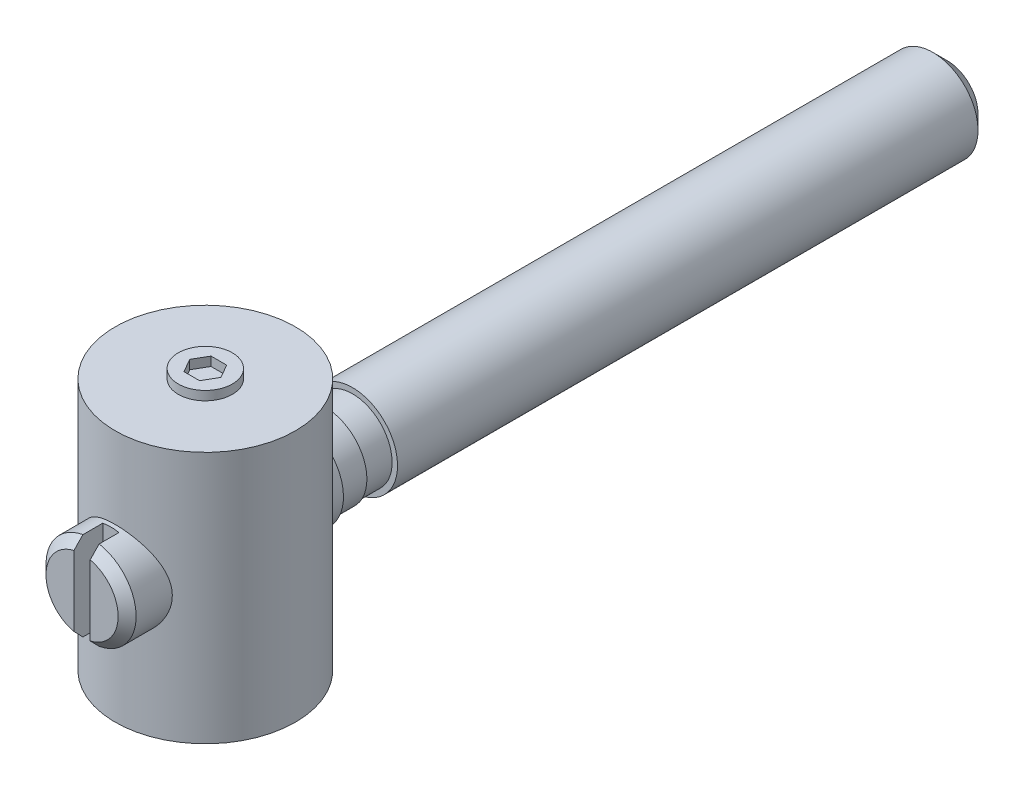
ISO-10303-21;
HEADER;
FILE_DESCRIPTION(('STEP AP214'),'2;1');
FILE_NAME('part.step','',(''),(''),'','','');
FILE_SCHEMA(('AUTOMOTIVE_DESIGN { 1 0 10303 214 1 1 1 1 }'));
ENDSEC;
DATA;
#1=APPLICATION_CONTEXT('core data for automotive mechanical design processes');
#2=APPLICATION_PROTOCOL_DEFINITION('international standard','automotive_design',2000,#1);
#3=PRODUCT_CONTEXT('',#1,'mechanical');
#4=PRODUCT('Part','Part','',(#3));
#5=PRODUCT_RELATED_PRODUCT_CATEGORY('part','',(#4));
#6=PRODUCT_DEFINITION_FORMATION('','',#4);
#7=PRODUCT_DEFINITION_CONTEXT('part definition',#1,'design');
#8=PRODUCT_DEFINITION('design','',#6,#7);
#9=PRODUCT_DEFINITION_SHAPE('','',#8);
#10=(LENGTH_UNIT() NAMED_UNIT(*) SI_UNIT(.MILLI.,.METRE.));
#11=(NAMED_UNIT(*) PLANE_ANGLE_UNIT() SI_UNIT($,.RADIAN.));
#12=(NAMED_UNIT(*) SI_UNIT($,.STERADIAN.) SOLID_ANGLE_UNIT());
#13=UNCERTAINTY_MEASURE_WITH_UNIT(LENGTH_MEASURE(1.E-05),#10,'distance_accuracy_value','');
#14=(GEOMETRIC_REPRESENTATION_CONTEXT(3) GLOBAL_UNCERTAINTY_ASSIGNED_CONTEXT((#13)) GLOBAL_UNIT_ASSIGNED_CONTEXT((#10,
#11,#12)) REPRESENTATION_CONTEXT('',''));
#15=CARTESIAN_POINT('',(0.,0.,0.));
#16=DIRECTION('',(0.,0.,1.));
#17=DIRECTION('',(1.,0.,0.));
#18=AXIS2_PLACEMENT_3D('',#15,#16,#17);
#19=CARTESIAN_POINT('',(0.,0.,6.8376561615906));
#20=DIRECTION('',(0.,0.,-1.));
#21=DIRECTION('',(0.,1.,0.));
#22=AXIS2_PLACEMENT_3D('',#19,#20,#21);
#23=PLANE('',#22);
#24=CARTESIAN_POINT('',(0.,0.,6.8376561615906));
#25=DIRECTION('',(0.,0.,-1.));
#26=DIRECTION('',(0.,1.,0.));
#27=AXIS2_PLACEMENT_3D('',#24,#25,#26);
#28=CIRCLE('',#27,2.);
#29=CARTESIAN_POINT('',(0.45,-1.9487175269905,6.8376561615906));
#30=VERTEX_POINT('',#29);
#31=CARTESIAN_POINT('',(0.45,1.94871752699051,6.8376561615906));
#32=VERTEX_POINT('',#31);
#33=EDGE_CURVE('E145',#30,#32,#28,.F.);
#34=ORIENTED_EDGE('',*,*,#33,.T.);
#35=DIRECTION('',(0.,1.,0.));
#36=VECTOR('',#35,1.);
#37=CARTESIAN_POINT('',(0.45,2.4591665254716,6.8376561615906));
#38=LINE('',#37,#36);
#39=EDGE_CURVE('E33',#30,#32,#38,.T.);
#40=ORIENTED_EDGE('',*,*,#39,.F.);
#41=EDGE_LOOP('',(#34,#40));
#42=FACE_BOUND('',#41,.T.);
#43=ADVANCED_FACE('F14',(#42),#23,.F.);
#44=CARTESIAN_POINT('',(-0.45,1.94871752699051,6.8376561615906));
#45=VERTEX_POINT('',#44);
#46=CARTESIAN_POINT('',(-0.45,-1.94871752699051,6.8376561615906));
#47=VERTEX_POINT('',#46);
#48=EDGE_CURVE('E134',#45,#47,#28,.F.);
#49=ORIENTED_EDGE('',*,*,#48,.T.);
#50=DIRECTION('',(0.,-1.,0.));
#51=VECTOR('',#50,1.);
#52=CARTESIAN_POINT('',(-0.45,2.4591665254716,6.8376561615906));
#53=LINE('',#52,#51);
#54=EDGE_CURVE('E297',#45,#47,#53,.T.);
#55=ORIENTED_EDGE('',*,*,#54,.F.);
#56=EDGE_LOOP('',(#49,#55));
#57=FACE_BOUND('',#56,.T.);
#58=ADVANCED_FACE('F181',(#57),#23,.F.);
#59=CARTESIAN_POINT('',(0.,0.,6.8376561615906));
#60=DIRECTION('',(0.,0.,-1.));
#61=DIRECTION('',(0.,1.,0.));
#62=AXIS2_PLACEMENT_3D('',#59,#60,#61);
#63=CONICAL_SURFACE('',#62,2.,0.785398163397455);
#64=CARTESIAN_POINT('',(0.45,-5.42557622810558,3.39345030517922));
#65=CARTESIAN_POINT('',(0.450000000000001,-5.23197486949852,3.58638323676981));
#66=CARTESIAN_POINT('',(0.450000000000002,-5.03834381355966,3.77928640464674));
#67=CARTESIAN_POINT('',(0.450000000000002,-4.65097063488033,4.16500261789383));
#68=CARTESIAN_POINT('',(0.450000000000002,-4.45722850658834,4.35781565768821));
#69=CARTESIAN_POINT('',(0.450000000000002,-4.06948715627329,4.7434147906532));
#70=CARTESIAN_POINT('',(0.450000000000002,-3.87548784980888,4.93620079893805));
#71=CARTESIAN_POINT('',(0.450000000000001,-3.48727998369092,5.32154115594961));
#72=CARTESIAN_POINT('',(0.450000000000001,-3.2930714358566,5.51409551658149));
#73=CARTESIAN_POINT('',(0.450000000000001,-2.91518099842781,5.88806787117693));
#74=CARTESIAN_POINT('',(0.450000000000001,-2.73151868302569,6.06950562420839));
#75=CARTESIAN_POINT('',(0.450000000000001,-2.45557699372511,6.3412370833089));
#76=CARTESIAN_POINT('',(0.450000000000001,-2.36351424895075,6.43175069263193));
#77=CARTESIAN_POINT('',(0.450000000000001,-2.17918444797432,6.61256698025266));
#78=CARTESIAN_POINT('',(0.450000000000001,-2.08691739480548,6.70286966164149));
#79=CARTESIAN_POINT('',(0.450000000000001,-1.90209588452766,6.88316070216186));
#80=CARTESIAN_POINT('',(0.450000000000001,-1.80954145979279,6.97314909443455));
#81=CARTESIAN_POINT('',(0.450000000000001,-1.62396889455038,7.15265715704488));
#82=CARTESIAN_POINT('',(0.450000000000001,-1.53095072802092,7.24217680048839));
#83=CARTESIAN_POINT('',(0.450000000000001,-1.34419825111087,7.42041554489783));
#84=CARTESIAN_POINT('',(0.450000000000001,-1.25046415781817,7.50913487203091));
#85=CARTESIAN_POINT('',(0.450000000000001,-1.10883677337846,7.64110521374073));
#86=CARTESIAN_POINT('',(0.450000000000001,-1.06145881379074,7.68490855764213));
#87=CARTESIAN_POINT('',(0.450000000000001,-0.966208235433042,7.77197331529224));
#88=CARTESIAN_POINT('',(0.45,-0.918335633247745,7.81523474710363));
#89=CARTESIAN_POINT('',(0.45,-0.843045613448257,7.88210740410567));
#90=CARTESIAN_POINT('',(0.450000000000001,-0.815880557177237,7.90600247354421));
#91=CARTESIAN_POINT('',(0.450000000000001,-0.761250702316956,7.95345109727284));
#92=CARTESIAN_POINT('',(0.450000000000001,-0.73378588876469,7.97700463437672));
#93=CARTESIAN_POINT('',(0.450000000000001,-0.678493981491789,8.02363326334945));
#94=CARTESIAN_POINT('',(0.450000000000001,-0.650667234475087,8.04670876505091));
#95=CARTESIAN_POINT('',(0.450000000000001,-0.594503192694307,8.09222815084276));
#96=CARTESIAN_POINT('',(0.45,-0.566165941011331,8.1146720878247));
#97=CARTESIAN_POINT('',(0.45,-0.508352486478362,8.15900200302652));
#98=CARTESIAN_POINT('',(0.450000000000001,-0.478865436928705,8.18087393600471));
#99=CARTESIAN_POINT('',(0.450000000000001,-0.418849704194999,8.22326079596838));
#100=CARTESIAN_POINT('',(0.450000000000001,-0.38831949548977,8.24377359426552));
#101=CARTESIAN_POINT('',(0.450000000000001,-0.326169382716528,8.28241108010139));
#102=CARTESIAN_POINT('',(0.450000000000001,-0.294562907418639,8.30055698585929));
#103=CARTESIAN_POINT('',(0.45,-0.229579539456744,8.33325387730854));
#104=CARTESIAN_POINT('',(0.45,-0.196208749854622,8.34781638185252));
#105=CARTESIAN_POINT('',(0.45,-0.135363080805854,8.3683918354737));
#106=CARTESIAN_POINT('',(0.450000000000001,-0.108310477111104,8.37560333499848));
#107=CARTESIAN_POINT('',(0.450000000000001,-0.0534100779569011,8.38529470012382));
#108=CARTESIAN_POINT('',(0.45,-0.0255652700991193,8.38779043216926));
#109=CARTESIAN_POINT('',(0.45,0.0301828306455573,8.38751005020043));
#110=CARTESIAN_POINT('',(0.450000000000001,0.0580860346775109,8.38471745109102));
#111=CARTESIAN_POINT('',(0.450000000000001,0.113057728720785,8.3744670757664));
#112=CARTESIAN_POINT('',(0.45,0.140123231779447,8.36699426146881));
#113=CARTESIAN_POINT('',(0.45,0.195788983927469,8.34767787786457));
#114=CARTESIAN_POINT('',(0.45,0.224253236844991,8.33545861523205));
#115=CARTESIAN_POINT('',(0.450000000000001,0.279866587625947,8.30828364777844));
#116=CARTESIAN_POINT('',(0.450000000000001,0.307012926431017,8.29332249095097));
#117=CARTESIAN_POINT('',(0.450000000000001,0.360452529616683,8.2614943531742));
#118=CARTESIAN_POINT('',(0.450000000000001,0.386736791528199,8.2446125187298));
#119=CARTESIAN_POINT('',(0.45,0.438454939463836,8.20965869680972));
#120=CARTESIAN_POINT('',(0.45,0.463889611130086,8.19158785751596));
#121=CARTESIAN_POINT('',(0.45,0.516620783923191,8.15278577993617));
#122=CARTESIAN_POINT('',(0.45,0.543853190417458,8.13196802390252));
#123=CARTESIAN_POINT('',(0.450000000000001,0.597765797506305,8.08962702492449));
#124=CARTESIAN_POINT('',(0.45,0.624445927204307,8.06810369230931));
#125=CARTESIAN_POINT('',(0.45,0.703891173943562,8.00276414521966));
#126=CARTESIAN_POINT('',(0.45,0.756036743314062,7.95819695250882));
#127=CARTESIAN_POINT('',(0.45,0.859426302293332,7.86786663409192));
#128=CARTESIAN_POINT('',(0.45,0.910668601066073,7.82210159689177));
#129=CARTESIAN_POINT('',(0.45,1.01249538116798,7.7298738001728));
#130=CARTESIAN_POINT('',(0.45,1.06308003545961,7.68341123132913));
#131=CARTESIAN_POINT('',(0.45,1.16360564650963,7.59020812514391));
#132=CARTESIAN_POINT('',(0.45,1.21354839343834,7.54346951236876));
#133=CARTESIAN_POINT('',(0.45,1.31312844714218,7.44966163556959));
#134=CARTESIAN_POINT('',(0.45,1.3627657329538,7.4025923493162));
#135=CARTESIAN_POINT('',(0.45,1.51124171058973,7.26112807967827));
#136=CARTESIAN_POINT('',(0.45,1.6097456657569,7.16638213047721));
#137=CARTESIAN_POINT('',(0.45,1.86456693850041,6.91997152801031));
#138=CARTESIAN_POINT('',(0.45,2.02049383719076,6.76790421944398));
#139=CARTESIAN_POINT('',(0.45,2.33171348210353,6.46311867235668));
#140=CARTESIAN_POINT('',(0.45,2.48700621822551,6.31040042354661));
#141=CARTESIAN_POINT('',(0.45,2.7972928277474,6.00451859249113));
#142=CARTESIAN_POINT('',(0.45,2.95228653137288,5.85135483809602));
#143=CARTESIAN_POINT('',(0.45,3.26204211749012,5.54479507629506));
#144=CARTESIAN_POINT('',(0.45,3.41680400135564,5.39139907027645));
#145=CARTESIAN_POINT('',(0.45,3.88099551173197,4.93085423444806));
#146=CARTESIAN_POINT('',(0.45,4.1901997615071,4.62347828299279));
#147=CARTESIAN_POINT('',(0.449999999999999,4.65370644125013,4.16226681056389));
#148=CARTESIAN_POINT('',(0.449999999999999,4.8081204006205,4.00854326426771));
#149=CARTESIAN_POINT('',(0.449999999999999,5.11688894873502,3.70103724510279));
#150=CARTESIAN_POINT('',(0.45,5.27124353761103,3.54725477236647));
#151=CARTESIAN_POINT('',(0.45,5.42557622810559,3.39345030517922));
#152=B_SPLINE_CURVE_WITH_KNOTS('',3,(#64,#65,#66,#67,#68,#69,#70,#71,#72,#73,#74,#75,#76,#77,
#78,#79,#80,#81,#82,#83,#84,#85,#86,#87,#88,#89,#90,#91,#92,#93,#94,#95,#96,#97,#98,#99,#100,
#101,#102,#103,#104,#105,#106,#107,#108,#109,#110,#111,#112,#113,#114,#115,#116,#117,#118,#119,
#120,#121,#122,#123,#124,#125,#126,#127,#128,#129,#130,#131,#132,#133,#134,#135,#136,#137,#138,
#139,#140,#141,#142,#143,#144,#145,#146,#147,#148,#149,#150,#151),.UNSPECIFIED.,.F.,.F.,(4,2,2,
2,2,2,2,2,2,2,2,2,2,2,2,2,2,2,2,2,2,2,2,2,2,2,2,2,2,2,2,2,2,2,2,2,2,2,2,2,2,2,2,4),(0.,
0.819964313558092,1.63997398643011,2.46047345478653,3.2809287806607,4.05543648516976,
4.44275311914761,4.83006404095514,5.21733280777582,5.60462355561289,5.99180119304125,
6.18537215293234,6.37893664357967,6.48747135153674,6.59601150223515,6.70445438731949,
6.81288816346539,6.92300307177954,7.0332865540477,7.14250119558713,7.2513600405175,
7.3350321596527,7.41842225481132,7.5020727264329,7.58599336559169,7.67870028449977,
7.77159358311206,7.86526158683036,7.95884042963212,8.06165788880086,8.16448846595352,
8.37024155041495,8.576345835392,8.78239477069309,8.98759769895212,9.19281455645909,
9.60283291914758,10.2562345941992,10.9096466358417,11.5633584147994,12.217066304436,
13.5250356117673,14.1786956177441,14.8323541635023),.UNSPECIFIED.);
#153=CARTESIAN_POINT('',(0.45,-2.4591665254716,6.3376561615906));
#154=VERTEX_POINT('',#153);
#155=EDGE_CURVE('E161',#154,#30,#152,.T.);
#156=ORIENTED_EDGE('',*,*,#155,.F.);
#157=CARTESIAN_POINT('',(0.,0.,6.3376561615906));
#158=DIRECTION('',(0.,0.,-1.));
#159=DIRECTION('',(0.,1.,0.));
#160=AXIS2_PLACEMENT_3D('',#157,#158,#159);
#161=CIRCLE('',#160,2.5);
#162=CARTESIAN_POINT('',(0.45,2.4591665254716,6.3376561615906));
#163=VERTEX_POINT('',#162);
#164=EDGE_CURVE('E141',#163,#154,#161,.T.);
#165=ORIENTED_EDGE('',*,*,#164,.F.);
#166=EDGE_CURVE('E154',#32,#163,#152,.T.);
#167=ORIENTED_EDGE('',*,*,#166,.F.);
#168=ORIENTED_EDGE('',*,*,#33,.F.);
#169=EDGE_LOOP('',(#156,#165,#167,#168));
#170=FACE_BOUND('',#169,.T.);
#171=ADVANCED_FACE('F168',(#170),#63,.T.);
#172=CARTESIAN_POINT('',(0.45,2.4591665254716,5.2376561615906));
#173=DIRECTION('',(1.,0.,0.));
#174=DIRECTION('',(0.,1.,0.));
#175=AXIS2_PLACEMENT_3D('',#172,#173,#174);
#176=PLANE('',#175);
#177=ORIENTED_EDGE('',*,*,#155,.T.);
#178=ORIENTED_EDGE('',*,*,#39,.T.);
#179=ORIENTED_EDGE('',*,*,#166,.T.);
#180=DIRECTION('',(0.,0.,1.));
#181=VECTOR('',#180,1.);
#182=CARTESIAN_POINT('',(0.45,2.4591665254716,5.2376561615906));
#183=LINE('',#182,#181);
#184=CARTESIAN_POINT('',(0.45,2.4591665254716,5.2376561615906));
#185=VERTEX_POINT('',#184);
#186=EDGE_CURVE('E125',#185,#163,#183,.T.);
#187=ORIENTED_EDGE('',*,*,#186,.F.);
#188=DIRECTION('',(0.,1.,0.));
#189=VECTOR('',#188,1.);
#190=CARTESIAN_POINT('',(0.45,2.4591665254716,5.2376561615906));
#191=LINE('',#190,#189);
#192=CARTESIAN_POINT('',(0.45,-2.4591665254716,5.2376561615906));
#193=VERTEX_POINT('',#192);
#194=EDGE_CURVE('E89',#193,#185,#191,.T.);
#195=ORIENTED_EDGE('',*,*,#194,.F.);
#196=DIRECTION('',(0.,0.,1.));
#197=VECTOR('',#196,1.);
#198=CARTESIAN_POINT('',(0.45,-2.4591665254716,5.2376561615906));
#199=LINE('',#198,#197);
#200=EDGE_CURVE('E308',#193,#154,#199,.T.);
#201=ORIENTED_EDGE('',*,*,#200,.T.);
#202=EDGE_LOOP('',(#177,#178,#179,#187,#195,#201));
#203=FACE_BOUND('',#202,.T.);
#204=ADVANCED_FACE('F172',(#203),#176,.F.);
#205=CARTESIAN_POINT('',(0.,0.,5.2376561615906));
#206=DIRECTION('',(0.,0.,1.));
#207=DIRECTION('',(0.,-1.,0.));
#208=AXIS2_PLACEMENT_3D('',#205,#206,#207);
#209=PLANE('',#208);
#210=CARTESIAN_POINT('',(0.,0.,5.2376561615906));
#211=DIRECTION('',(0.,0.,1.));
#212=DIRECTION('',(0.,-1.,0.));
#213=AXIS2_PLACEMENT_3D('',#210,#211,#212);
#214=CIRCLE('',#213,2.5);
#215=CARTESIAN_POINT('',(-0.45,-2.4591665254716,5.2376561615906));
#216=VERTEX_POINT('',#215);
#217=EDGE_CURVE('E299',#216,#193,#214,.T.);
#218=ORIENTED_EDGE('',*,*,#217,.T.);
#219=ORIENTED_EDGE('',*,*,#194,.T.);
#220=CARTESIAN_POINT('',(0.,0.,5.2376561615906));
#221=DIRECTION('',(0.,0.,1.));
#222=DIRECTION('',(0.,-1.,0.));
#223=AXIS2_PLACEMENT_3D('',#220,#221,#222);
#224=CIRCLE('',#223,2.5);
#225=CARTESIAN_POINT('',(-0.45,2.4591665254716,5.2376561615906));
#226=VERTEX_POINT('',#225);
#227=EDGE_CURVE('E333',#185,#226,#224,.T.);
#228=ORIENTED_EDGE('',*,*,#227,.T.);
#229=DIRECTION('',(0.,-1.,0.));
#230=VECTOR('',#229,1.);
#231=CARTESIAN_POINT('',(-0.45,2.4591665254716,5.2376561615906));
#232=LINE('',#231,#230);
#233=EDGE_CURVE('E120',#226,#216,#232,.T.);
#234=ORIENTED_EDGE('',*,*,#233,.T.);
#235=EDGE_LOOP('',(#218,#219,#228,#234));
#236=FACE_BOUND('',#235,.T.);
#237=ADVANCED_FACE('F176',(#236),#209,.T.);
#238=CARTESIAN_POINT('',(-0.45,2.4591665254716,5.2376561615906));
#239=DIRECTION('',(-1.,0.,0.));
#240=DIRECTION('',(0.,-1.,0.));
#241=AXIS2_PLACEMENT_3D('',#238,#239,#240);
#242=PLANE('',#241);
#243=CARTESIAN_POINT('',(-0.45,5.42557622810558,3.39345030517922));
#244=CARTESIAN_POINT('',(-0.45,5.23197486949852,3.58638323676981));
#245=CARTESIAN_POINT('',(-0.45,5.03834381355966,3.77928640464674));
#246=CARTESIAN_POINT('',(-0.45,4.65097063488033,4.16500261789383));
#247=CARTESIAN_POINT('',(-0.45,4.45722850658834,4.35781565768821));
#248=CARTESIAN_POINT('',(-0.45,4.06948715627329,4.7434147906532));
#249=CARTESIAN_POINT('',(-0.45,3.87548784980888,4.93620079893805));
#250=CARTESIAN_POINT('',(-0.45,3.48727998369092,5.32154115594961));
#251=CARTESIAN_POINT('',(-0.45,3.2930714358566,5.5140955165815));
#252=CARTESIAN_POINT('',(-0.45,2.9151809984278,5.88806787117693));
#253=CARTESIAN_POINT('',(-0.45,2.73151868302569,6.06950562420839));
#254=CARTESIAN_POINT('',(-0.45,2.45557699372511,6.3412370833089));
#255=CARTESIAN_POINT('',(-0.45,2.36351424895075,6.43175069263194));
#256=CARTESIAN_POINT('',(-0.45,2.17918444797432,6.61256698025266));
#257=CARTESIAN_POINT('',(-0.45,2.08691739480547,6.7028696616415));
#258=CARTESIAN_POINT('',(-0.45,1.90209588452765,6.88316070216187));
#259=CARTESIAN_POINT('',(-0.45,1.80954145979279,6.97314909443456));
#260=CARTESIAN_POINT('',(-0.45,1.62396889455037,7.15265715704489));
#261=CARTESIAN_POINT('',(-0.45,1.53095072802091,7.2421768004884));
#262=CARTESIAN_POINT('',(-0.45,1.34419825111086,7.42041554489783));
#263=CARTESIAN_POINT('',(-0.45,1.25046415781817,7.50913487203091));
#264=CARTESIAN_POINT('',(-0.45,1.10883677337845,7.64110521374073));
#265=CARTESIAN_POINT('',(-0.45,1.06145881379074,7.68490855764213));
#266=CARTESIAN_POINT('',(-0.45,0.966208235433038,7.77197331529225));
#267=CARTESIAN_POINT('',(-0.45,0.918335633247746,7.81523474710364));
#268=CARTESIAN_POINT('',(-0.45,0.843045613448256,7.88210740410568));
#269=CARTESIAN_POINT('',(-0.45,0.815880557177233,7.90600247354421));
#270=CARTESIAN_POINT('',(-0.45,0.761250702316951,7.95345109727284));
#271=CARTESIAN_POINT('',(-0.45,0.733785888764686,7.97700463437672));
#272=CARTESIAN_POINT('',(-0.45,0.678493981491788,8.02363326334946));
#273=CARTESIAN_POINT('',(-0.45,0.650667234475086,8.04670876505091));
#274=CARTESIAN_POINT('',(-0.45,0.594503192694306,8.09222815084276));
#275=CARTESIAN_POINT('',(-0.45,0.56616594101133,8.11467208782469));
#276=CARTESIAN_POINT('',(-0.45,0.508352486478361,8.15900200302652));
#277=CARTESIAN_POINT('',(-0.45,0.478865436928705,8.18087393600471));
#278=CARTESIAN_POINT('',(-0.45,0.418849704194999,8.22326079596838));
#279=CARTESIAN_POINT('',(-0.45,0.38831949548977,8.24377359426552));
#280=CARTESIAN_POINT('',(-0.45,0.326169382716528,8.28241108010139));
#281=CARTESIAN_POINT('',(-0.45,0.29456290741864,8.30055698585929));
#282=CARTESIAN_POINT('',(-0.45,0.229579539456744,8.33325387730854));
#283=CARTESIAN_POINT('',(-0.45,0.196208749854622,8.34781638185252));
#284=CARTESIAN_POINT('',(-0.45,0.135363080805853,8.3683918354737));
#285=CARTESIAN_POINT('',(-0.45,0.108310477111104,8.37560333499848));
#286=CARTESIAN_POINT('',(-0.45,0.0534100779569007,8.38529470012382));
#287=CARTESIAN_POINT('',(-0.45,0.0255652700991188,8.38779043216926));
#288=CARTESIAN_POINT('',(-0.45,-0.030182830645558,8.38751005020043));
#289=CARTESIAN_POINT('',(-0.45,-0.0580860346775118,8.38471745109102));
#290=CARTESIAN_POINT('',(-0.45,-0.113057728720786,8.3744670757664));
#291=CARTESIAN_POINT('',(-0.45,-0.140123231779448,8.36699426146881));
#292=CARTESIAN_POINT('',(-0.45,-0.195788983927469,8.34767787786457));
#293=CARTESIAN_POINT('',(-0.45,-0.224253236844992,8.33545861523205));
#294=CARTESIAN_POINT('',(-0.45,-0.279866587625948,8.30828364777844));
#295=CARTESIAN_POINT('',(-0.45,-0.307012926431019,8.29332249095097));
#296=CARTESIAN_POINT('',(-0.45,-0.360452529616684,8.2614943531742));
#297=CARTESIAN_POINT('',(-0.45,-0.3867367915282,8.2446125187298));
#298=CARTESIAN_POINT('',(-0.45,-0.438454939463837,8.20965869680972));
#299=CARTESIAN_POINT('',(-0.45,-0.463889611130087,8.19158785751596));
#300=CARTESIAN_POINT('',(-0.45,-0.516620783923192,8.15278577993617));
#301=CARTESIAN_POINT('',(-0.45,-0.54385319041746,8.13196802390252));
#302=CARTESIAN_POINT('',(-0.45,-0.597765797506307,8.08962702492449));
#303=CARTESIAN_POINT('',(-0.45,-0.62444592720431,8.06810369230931));
#304=CARTESIAN_POINT('',(-0.45,-0.703891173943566,8.00276414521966));
#305=CARTESIAN_POINT('',(-0.45,-0.756036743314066,7.95819695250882));
#306=CARTESIAN_POINT('',(-0.45,-0.859426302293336,7.86786663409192));
#307=CARTESIAN_POINT('',(-0.45,-0.910668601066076,7.82210159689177));
#308=CARTESIAN_POINT('',(-0.45,-1.01249538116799,7.72987380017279));
#309=CARTESIAN_POINT('',(-0.45,-1.06308003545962,7.68341123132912));
#310=CARTESIAN_POINT('',(-0.45,-1.16360564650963,7.5902081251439));
#311=CARTESIAN_POINT('',(-0.45,-1.21354839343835,7.54346951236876));
#312=CARTESIAN_POINT('',(-0.45,-1.31312844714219,7.44966163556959));
#313=CARTESIAN_POINT('',(-0.45,-1.3627657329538,7.4025923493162));
#314=CARTESIAN_POINT('',(-0.45,-1.51124171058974,7.26112807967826));
#315=CARTESIAN_POINT('',(-0.45,-1.60974566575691,7.1663821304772));
#316=CARTESIAN_POINT('',(-0.45,-1.86456693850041,6.9199715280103));
#317=CARTESIAN_POINT('',(-0.45,-2.02049383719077,6.76790421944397));
#318=CARTESIAN_POINT('',(-0.45,-2.33171348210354,6.46311867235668));
#319=CARTESIAN_POINT('',(-0.45,-2.48700621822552,6.31040042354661));
#320=CARTESIAN_POINT('',(-0.45,-2.7972928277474,6.00451859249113));
#321=CARTESIAN_POINT('',(-0.45,-2.95228653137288,5.85135483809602));
#322=CARTESIAN_POINT('',(-0.45,-3.26204211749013,5.54479507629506));
#323=CARTESIAN_POINT('',(-0.45,-3.41680400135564,5.39139907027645));
#324=CARTESIAN_POINT('',(-0.45,-3.88099551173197,4.93085423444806));
#325=CARTESIAN_POINT('',(-0.45,-4.1901997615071,4.62347828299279));
#326=CARTESIAN_POINT('',(-0.45,-4.65370644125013,4.16226681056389));
#327=CARTESIAN_POINT('',(-0.45,-4.8081204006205,4.00854326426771));
#328=CARTESIAN_POINT('',(-0.45,-5.11688894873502,3.7010372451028));
#329=CARTESIAN_POINT('',(-0.45,-5.27124353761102,3.54725477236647));
#330=CARTESIAN_POINT('',(-0.45,-5.42557622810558,3.39345030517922));
#331=B_SPLINE_CURVE_WITH_KNOTS('',3,(#243,#244,#245,#246,#247,#248,#249,#250,#251,#252,#253,
#254,#255,#256,#257,#258,#259,#260,#261,#262,#263,#264,#265,#266,#267,#268,#269,#270,#271,#272,
#273,#274,#275,#276,#277,#278,#279,#280,#281,#282,#283,#284,#285,#286,#287,#288,#289,#290,#291,
#292,#293,#294,#295,#296,#297,#298,#299,#300,#301,#302,#303,#304,#305,#306,#307,#308,#309,#310,
#311,#312,#313,#314,#315,#316,#317,#318,#319,#320,#321,#322,#323,#324,#325,#326,#327,#328,#329,
#330),.UNSPECIFIED.,.F.,.F.,(4,2,2,2,2,2,2,2,2,2,2,2,2,2,2,2,2,2,2,2,2,2,2,2,2,2,2,2,2,2,2,2,2,
2,2,2,2,2,2,2,2,2,2,4),(0.,0.819964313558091,1.63997398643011,2.46047345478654,3.2809287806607,
4.05543648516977,4.44275311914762,4.83006404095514,5.21733280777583,5.60462355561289,
5.99180119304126,6.18537215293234,6.37893664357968,6.48747135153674,6.59601150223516,
6.70445438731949,6.81288816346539,6.92300307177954,7.0332865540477,7.14250119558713,
7.2513600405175,7.3350321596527,7.41842225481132,7.5020727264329,7.58599336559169,
7.67870028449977,7.77159358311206,7.86526158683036,7.95884042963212,8.06165788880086,
8.16448846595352,8.37024155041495,8.57634583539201,8.78239477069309,8.98759769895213,
9.19281455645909,9.60283291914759,10.2562345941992,10.9096466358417,11.5633584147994,
12.217066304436,13.5250356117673,14.1786956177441,14.8323541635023),.UNSPECIFIED.);
#332=CARTESIAN_POINT('',(-0.45,2.4591665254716,6.3376561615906));
#333=VERTEX_POINT('',#332);
#334=EDGE_CURVE('E117',#333,#45,#331,.T.);
#335=ORIENTED_EDGE('',*,*,#334,.T.);
#336=ORIENTED_EDGE('',*,*,#54,.T.);
#337=CARTESIAN_POINT('',(-0.45,-2.4591665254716,6.3376561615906));
#338=VERTEX_POINT('',#337);
#339=EDGE_CURVE('E135',#47,#338,#331,.T.);
#340=ORIENTED_EDGE('',*,*,#339,.T.);
#341=DIRECTION('',(0.,0.,1.));
#342=VECTOR('',#341,1.);
#343=CARTESIAN_POINT('',(-0.45,-2.4591665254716,5.2376561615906));
#344=LINE('',#343,#342);
#345=EDGE_CURVE('E124',#216,#338,#344,.T.);
#346=ORIENTED_EDGE('',*,*,#345,.F.);
#347=ORIENTED_EDGE('',*,*,#233,.F.);
#348=DIRECTION('',(0.,0.,1.));
#349=VECTOR('',#348,1.);
#350=CARTESIAN_POINT('',(-0.45,2.4591665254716,5.2376561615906));
#351=LINE('',#350,#349);
#352=EDGE_CURVE('E114',#226,#333,#351,.T.);
#353=ORIENTED_EDGE('',*,*,#352,.T.);
#354=EDGE_LOOP('',(#335,#336,#340,#346,#347,#353));
#355=FACE_BOUND('',#354,.T.);
#356=ADVANCED_FACE('F116',(#355),#242,.F.);
#357=ORIENTED_EDGE('',*,*,#334,.F.);
#358=EDGE_CURVE('E132',#338,#333,#161,.T.);
#359=ORIENTED_EDGE('',*,*,#358,.F.);
#360=ORIENTED_EDGE('',*,*,#339,.F.);
#361=ORIENTED_EDGE('',*,*,#48,.F.);
#362=EDGE_LOOP('',(#357,#359,#360,#361));
#363=FACE_BOUND('',#362,.T.);
#364=ADVANCED_FACE('F130',(#363),#63,.T.);
#365=CARTESIAN_POINT('',(0.,0.,37.1330220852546));
#366=DIRECTION('',(0.,0.,1.));
#367=DIRECTION('',(0.,-1.,0.));
#368=AXIS2_PLACEMENT_3D('',#365,#366,#367);
#369=CYLINDRICAL_SURFACE('',#368,2.5);
#370=ORIENTED_EDGE('',*,*,#358,.T.);
#371=ORIENTED_EDGE('',*,*,#352,.F.);
#372=ORIENTED_EDGE('',*,*,#227,.F.);
#373=ORIENTED_EDGE('',*,*,#186,.T.);
#374=ORIENTED_EDGE('',*,*,#164,.T.);
#375=ORIENTED_EDGE('',*,*,#200,.F.);
#376=ORIENTED_EDGE('',*,*,#217,.F.);
#377=ORIENTED_EDGE('',*,*,#345,.T.);
#378=EDGE_LOOP('',(#370,#371,#372,#373,#374,#375,#376,#377));
#379=FACE_BOUND('',#378,.T.);
#380=CARTESIAN_POINT('',(0.,-2.5,5.));
#381=CARTESIAN_POINT('',(-0.131426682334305,-2.49999033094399,4.99999177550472));
#382=CARTESIAN_POINT('',(-0.263015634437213,-2.48957443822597,4.99476199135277));
#383=CARTESIAN_POINT('',(-0.522301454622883,-2.44836817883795,4.9743541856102));
#384=CARTESIAN_POINT('',(-0.649990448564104,-2.41753911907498,4.9591572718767));
#385=CARTESIAN_POINT('',(-0.897333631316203,-2.33701537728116,4.92040690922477));
#386=CARTESIAN_POINT('',(-1.01701694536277,-2.28739401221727,4.89688595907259));
#387=CARTESIAN_POINT('',(-1.24618160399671,-2.1710734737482,4.84364443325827));
#388=CARTESIAN_POINT('',(-1.3556637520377,-2.10437564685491,4.81392434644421));
#389=CARTESIAN_POINT('',(-1.56876952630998,-1.95120686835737,4.74890645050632));
#390=CARTESIAN_POINT('',(-1.67163802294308,-1.86378379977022,4.71337997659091));
#391=CARTESIAN_POINT('',(-1.86194861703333,-1.67369630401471,4.64149925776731));
#392=CARTESIAN_POINT('',(-1.94937895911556,-1.57102037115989,4.60514440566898));
#393=CARTESIAN_POINT('',(-2.11312999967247,-1.34379162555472,4.53247377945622));
#394=CARTESIAN_POINT('',(-2.18806333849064,-1.21815975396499,4.49637967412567));
#395=CARTESIAN_POINT('',(-2.31542056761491,-0.954081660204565,4.43214946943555));
#396=CARTESIAN_POINT('',(-2.36786053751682,-0.815644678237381,4.40400769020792));
#397=CARTESIAN_POINT('',(-2.44533110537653,-0.538337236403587,4.36144667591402));
#398=CARTESIAN_POINT('',(-2.47181464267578,-0.399988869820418,4.34630678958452));
#399=CARTESIAN_POINT('',(-2.50106748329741,-0.120052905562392,4.3295472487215));
#400=CARTESIAN_POINT('',(-2.50386022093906,0.0215313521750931,4.3279142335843));
#401=CARTESIAN_POINT('',(-2.48671821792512,0.285715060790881,4.33777325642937));
#402=CARTESIAN_POINT('',(-2.46946139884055,0.408560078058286,4.34771909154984));
#403=CARTESIAN_POINT('',(-2.41734962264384,0.649304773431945,4.37690571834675));
#404=CARTESIAN_POINT('',(-2.38248905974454,0.767202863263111,4.39614947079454));
#405=CARTESIAN_POINT('',(-2.29552445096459,0.998072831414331,4.44218691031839));
#406=CARTESIAN_POINT('',(-2.24303766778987,1.11086599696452,4.46914601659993));
#407=CARTESIAN_POINT('',(-2.12260421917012,1.32658573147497,4.52758510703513));
#408=CARTESIAN_POINT('',(-2.0546506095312,1.42950783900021,4.55906711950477));
#409=CARTESIAN_POINT('',(-1.89516513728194,1.63630313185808,4.62782894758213));
#410=CARTESIAN_POINT('',(-1.8017361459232,1.7386421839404,4.66533775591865));
#411=CARTESIAN_POINT('',(-1.59888894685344,1.92683854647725,4.73869058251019));
#412=CARTESIAN_POINT('',(-1.48946314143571,2.01268798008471,4.77453379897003));
#413=CARTESIAN_POINT('',(-1.25129126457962,2.16921415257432,4.84254968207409));
#414=CARTESIAN_POINT('',(-1.12188397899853,2.23900118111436,4.87447460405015));
#415=CARTESIAN_POINT('',(-0.851165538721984,2.35524257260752,4.92894702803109));
#416=CARTESIAN_POINT('',(-0.709863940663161,2.4017154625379,4.95150197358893));
#417=CARTESIAN_POINT('',(-0.431916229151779,2.46618850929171,4.98310834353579));
#418=CARTESIAN_POINT('',(-0.295853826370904,2.486228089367,4.9931234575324));
#419=CARTESIAN_POINT('',(-0.0219489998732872,2.50366182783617,5.00182533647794));
#420=CARTESIAN_POINT('',(0.11589254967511,2.50106671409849,5.00051746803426));
#421=CARTESIAN_POINT('',(0.378082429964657,2.4744832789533,4.98727980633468));
#422=CARTESIAN_POINT('',(0.502648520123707,2.45216866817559,4.97618114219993));
#423=CARTESIAN_POINT('',(0.746017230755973,2.38940482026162,4.94555428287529));
#424=CARTESIAN_POINT('',(0.864819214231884,2.34895358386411,4.92602515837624));
#425=CARTESIAN_POINT('',(1.09722152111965,2.25000383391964,4.87960628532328));
#426=CARTESIAN_POINT('',(1.21057599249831,2.19102237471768,4.85252204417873));
#427=CARTESIAN_POINT('',(1.42615340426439,2.05723116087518,4.7935993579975));
#428=CARTESIAN_POINT('',(1.52837157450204,1.98241466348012,4.76175888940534));
#429=CARTESIAN_POINT('',(1.72941922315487,1.81059893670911,4.69270553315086));
#430=CARTESIAN_POINT('',(1.82693019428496,1.7121428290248,4.65527212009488));
#431=CARTESIAN_POINT('',(2.0046408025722,1.50018712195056,4.58155978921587));
#432=CARTESIAN_POINT('',(2.08482846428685,1.38667720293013,4.54528168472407));
#433=CARTESIAN_POINT('',(2.22926978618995,1.14089086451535,4.4762798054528));
#434=CARTESIAN_POINT('',(2.29256373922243,1.00797183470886,4.44381323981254));
#435=CARTESIAN_POINT('',(2.39520706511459,0.731224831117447,4.38935180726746));
#436=CARTESIAN_POINT('',(2.43458729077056,0.587411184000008,4.36734345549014));
#437=CARTESIAN_POINT('',(2.48465421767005,0.307724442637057,4.33903752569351));
#438=CARTESIAN_POINT('',(2.4977324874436,0.172414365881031,4.33143458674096));
#439=CARTESIAN_POINT('',(2.50172288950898,-0.0986176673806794,4.32913386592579));
#440=CARTESIAN_POINT('',(2.49264462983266,-0.23433941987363,4.3344304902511));
#441=CARTESIAN_POINT('',(2.45481530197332,-0.488708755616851,4.35594655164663));
#442=CARTESIAN_POINT('',(2.42802074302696,-0.607751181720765,4.37107736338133));
#443=CARTESIAN_POINT('',(2.35793843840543,-0.839520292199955,4.40927540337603));
#444=CARTESIAN_POINT('',(2.31464538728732,-0.952244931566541,4.43234518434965));
#445=CARTESIAN_POINT('',(2.20953919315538,-1.17656215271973,4.48571326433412));
#446=CARTESIAN_POINT('',(2.14667719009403,-1.28756985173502,4.5163930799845));
#447=CARTESIAN_POINT('',(2.0053780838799,-1.49818624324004,4.58088327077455));
#448=CARTESIAN_POINT('',(1.92693287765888,-1.59778896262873,4.61469526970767));
#449=CARTESIAN_POINT('',(1.74550556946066,-1.79535536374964,4.68655816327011));
#450=CARTESIAN_POINT('',(1.6407002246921,-1.89164936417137,4.72462491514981));
#451=CARTESIAN_POINT('',(1.41539785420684,-2.06565584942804,4.79694347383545));
#452=CARTESIAN_POINT('',(1.29489242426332,-2.14335831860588,4.83119321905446));
#453=CARTESIAN_POINT('',(1.03978808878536,-2.2780969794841,4.89245149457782));
#454=CARTESIAN_POINT('',(0.905095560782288,-2.33498316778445,4.91940711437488));
#455=CARTESIAN_POINT('',(0.696328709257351,-2.4021838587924,4.95177960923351));
#456=CARTESIAN_POINT('',(0.625670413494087,-2.42155539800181,4.96122314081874));
#457=CARTESIAN_POINT('',(0.482623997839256,-2.4540659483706,4.97717127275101));
#458=CARTESIAN_POINT('',(0.4102369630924,-2.46720876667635,4.98367766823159));
#459=CARTESIAN_POINT('',(0.28151868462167,-2.48473747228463,4.9923820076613));
#460=CARTESIAN_POINT('',(0.225408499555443,-2.49045493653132,4.99523288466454));
#461=CARTESIAN_POINT('',(0.112875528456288,-2.49808832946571,4.99904367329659));
#462=CARTESIAN_POINT('',(0.0564527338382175,-2.50000415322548,5.00000353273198));
#463=CARTESIAN_POINT('',(0.,-2.5,5.));
#464=B_SPLINE_CURVE_WITH_KNOTS('',3,(#380,#381,#382,#383,#384,#385,#386,#387,#388,#389,#390,
#391,#392,#393,#394,#395,#396,#397,#398,#399,#400,#401,#402,#403,#404,#405,#406,#407,#408,#409,
#410,#411,#412,#413,#414,#415,#416,#417,#418,#419,#420,#421,#422,#423,#424,#425,#426,#427,#428,
#429,#430,#431,#432,#433,#434,#435,#436,#437,#438,#439,#440,#441,#442,#443,#444,#445,#446,#447,
#448,#449,#450,#451,#452,#453,#454,#455,#456,#457,#458,#459,#460,#461,#462,#463),.UNSPECIFIED.,
.T.,.F.,(4,2,2,2,2,2,2,2,2,2,2,2,2,2,2,2,2,2,2,2,2,2,2,2,2,2,2,2,2,2,2,2,2,2,2,2,2,2,2,2,2,4),
(0.,0.394060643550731,0.788870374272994,1.18215538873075,1.57540940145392,1.99245439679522,
2.40981559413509,2.85954316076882,3.30894869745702,3.73145030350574,4.15353393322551,
4.52514281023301,4.89687009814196,5.27725600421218,5.65781303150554,6.08662353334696,
6.51563836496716,6.96457555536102,7.41315542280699,7.82458226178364,8.2358141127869,
8.61517266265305,8.99457304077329,9.38482140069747,9.77523626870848,10.2039902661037,
10.6330397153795,11.0828670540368,11.53211279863,11.9382326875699,12.3441764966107,
12.7114482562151,13.0788382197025,13.4709114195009,13.8631890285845,14.303131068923,
14.7433095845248,15.1866003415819,15.407934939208,15.6291340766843,15.7983933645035,
15.9676573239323),.UNSPECIFIED.);
#465=CARTESIAN_POINT('',(0.,-2.5,5.));
#466=VERTEX_POINT('',#465);
#467=EDGE_CURVE('E24',#466,#466,#464,.T.);
#468=ORIENTED_EDGE('',*,*,#467,.F.);
#469=EDGE_LOOP('',(#468));
#470=FACE_BOUND('',#469,.T.);
#471=ADVANCED_FACE('F138',(#379,#470),#369,.T.);
#472=CARTESIAN_POINT('',(0.,7.,0.));
#473=DIRECTION('',(0.,1.,0.));
#474=DIRECTION('',(-1.,0.,0.));
#475=AXIS2_PLACEMENT_3D('',#472,#473,#474);
#476=PLANE('',#475);
#477=DIRECTION('',(-1.,0.,0.));
#478=VECTOR('',#477,1.);
#479=CARTESIAN_POINT('',(-0.43301270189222,7.,0.75));
#480=LINE('',#479,#478);
#481=CARTESIAN_POINT('',(0.43301270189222,7.,0.75));
#482=VERTEX_POINT('',#481);
#483=CARTESIAN_POINT('',(-0.433012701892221,7.,0.75));
#484=VERTEX_POINT('',#483);
#485=EDGE_CURVE('E561',#482,#484,#480,.T.);
#486=ORIENTED_EDGE('',*,*,#485,.F.);
#487=DIRECTION('',(-0.5,0.,0.866025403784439));
#488=VECTOR('',#487,1.);
#489=CARTESIAN_POINT('',(0.43301270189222,7.,0.75));
#490=LINE('',#489,#488);
#491=CARTESIAN_POINT('',(0.866025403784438,7.,0.));
#492=VERTEX_POINT('',#491);
#493=EDGE_CURVE('E565',#492,#482,#490,.T.);
#494=ORIENTED_EDGE('',*,*,#493,.F.);
#495=DIRECTION('',(0.5,0.,0.866025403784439));
#496=VECTOR('',#495,1.);
#497=CARTESIAN_POINT('',(0.866025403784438,7.,0.));
#498=LINE('',#497,#496);
#499=CARTESIAN_POINT('',(0.43301270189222,7.,-0.75));
#500=VERTEX_POINT('',#499);
#501=EDGE_CURVE('E263',#500,#492,#498,.T.);
#502=ORIENTED_EDGE('',*,*,#501,.F.);
#503=DIRECTION('',(1.,0.,0.));
#504=VECTOR('',#503,1.);
#505=CARTESIAN_POINT('',(0.43301270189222,7.,-0.75));
#506=LINE('',#505,#504);
#507=CARTESIAN_POINT('',(-0.43301270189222,7.,-0.75));
#508=VERTEX_POINT('',#507);
#509=EDGE_CURVE('E578',#508,#500,#506,.T.);
#510=ORIENTED_EDGE('',*,*,#509,.F.);
#511=DIRECTION('',(0.5,0.,-0.866025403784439));
#512=VECTOR('',#511,1.);
#513=CARTESIAN_POINT('',(-0.43301270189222,7.,-0.75));
#514=LINE('',#513,#512);
#515=CARTESIAN_POINT('',(-0.86602540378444,7.,0.));
#516=VERTEX_POINT('',#515);
#517=EDGE_CURVE('E81',#516,#508,#514,.T.);
#518=ORIENTED_EDGE('',*,*,#517,.F.);
#519=DIRECTION('',(-0.5,0.,-0.866025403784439));
#520=VECTOR('',#519,1.);
#521=CARTESIAN_POINT('',(-0.86602540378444,7.,0.));
#522=LINE('',#521,#520);
#523=EDGE_CURVE('E201',#484,#516,#522,.T.);
#524=ORIENTED_EDGE('',*,*,#523,.F.);
#525=EDGE_LOOP('',(#486,#494,#502,#510,#518,#524));
#526=FACE_BOUND('',#525,.T.);
#527=ADVANCED_FACE('F221',(#526),#476,.T.);
#528=CARTESIAN_POINT('',(-0.43301270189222,6.3,0.75));
#529=DIRECTION('',(0.,0.,1.));
#530=DIRECTION('',(1.,0.,0.));
#531=AXIS2_PLACEMENT_3D('',#528,#529,#530);
#532=PLANE('',#531);
#533=DIRECTION('',(0.,1.,0.));
#534=VECTOR('',#533,1.);
#535=CARTESIAN_POINT('',(0.43301270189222,6.3,0.75));
#536=LINE('',#535,#534);
#537=CARTESIAN_POINT('',(0.43301270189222,7.5,0.75));
#538=VERTEX_POINT('',#537);
#539=EDGE_CURVE('E273',#482,#538,#536,.T.);
#540=ORIENTED_EDGE('',*,*,#539,.F.);
#541=ORIENTED_EDGE('',*,*,#485,.T.);
#542=DIRECTION('',(0.,1.,0.));
#543=VECTOR('',#542,1.);
#544=CARTESIAN_POINT('',(-0.43301270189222,6.3,0.75));
#545=LINE('',#544,#543);
#546=CARTESIAN_POINT('',(-0.43301270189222,7.5,0.75));
#547=VERTEX_POINT('',#546);
#548=EDGE_CURVE('E75',#484,#547,#545,.T.);
#549=ORIENTED_EDGE('',*,*,#548,.T.);
#550=DIRECTION('',(1.,0.,0.));
#551=VECTOR('',#550,1.);
#552=CARTESIAN_POINT('',(-0.43301270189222,7.5,0.75));
#553=LINE('',#552,#551);
#554=EDGE_CURVE('E286',#547,#538,#553,.T.);
#555=ORIENTED_EDGE('',*,*,#554,.T.);
#556=EDGE_LOOP('',(#540,#541,#549,#555));
#557=FACE_BOUND('',#556,.T.);
#558=ADVANCED_FACE('F223',(#557),#532,.F.);
#559=CARTESIAN_POINT('',(0.43301270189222,6.3,0.75));
#560=DIRECTION('',(0.866025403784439,0.,0.5));
#561=DIRECTION('',(0.5,0.,-0.866025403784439));
#562=AXIS2_PLACEMENT_3D('',#559,#560,#561);
#563=PLANE('',#562);
#564=DIRECTION('',(0.,1.,0.));
#565=VECTOR('',#564,1.);
#566=CARTESIAN_POINT('',(0.866025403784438,6.3,0.));
#567=LINE('',#566,#565);
#568=CARTESIAN_POINT('',(0.866025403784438,7.5,0.));
#569=VERTEX_POINT('',#568);
#570=EDGE_CURVE('E270',#492,#569,#567,.T.);
#571=ORIENTED_EDGE('',*,*,#570,.F.);
#572=ORIENTED_EDGE('',*,*,#493,.T.);
#573=ORIENTED_EDGE('',*,*,#539,.T.);
#574=DIRECTION('',(0.5,0.,-0.866025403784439));
#575=VECTOR('',#574,1.);
#576=CARTESIAN_POINT('',(0.43301270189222,7.5,0.75));
#577=LINE('',#576,#575);
#578=EDGE_CURVE('E283',#538,#569,#577,.T.);
#579=ORIENTED_EDGE('',*,*,#578,.T.);
#580=EDGE_LOOP('',(#571,#572,#573,#579));
#581=FACE_BOUND('',#580,.T.);
#582=ADVANCED_FACE('F230',(#581),#563,.F.);
#583=CARTESIAN_POINT('',(0.866025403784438,6.3,0.));
#584=DIRECTION('',(0.866025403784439,0.,-0.5));
#585=DIRECTION('',(-0.5,0.,-0.866025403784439));
#586=AXIS2_PLACEMENT_3D('',#583,#584,#585);
#587=PLANE('',#586);
#588=DIRECTION('',(0.,1.,0.));
#589=VECTOR('',#588,1.);
#590=CARTESIAN_POINT('',(0.43301270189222,6.3,-0.75));
#591=LINE('',#590,#589);
#592=CARTESIAN_POINT('',(0.43301270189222,7.5,-0.75));
#593=VERTEX_POINT('',#592);
#594=EDGE_CURVE('E262',#500,#593,#591,.T.);
#595=ORIENTED_EDGE('',*,*,#594,.F.);
#596=ORIENTED_EDGE('',*,*,#501,.T.);
#597=ORIENTED_EDGE('',*,*,#570,.T.);
#598=DIRECTION('',(-0.5,0.,-0.866025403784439));
#599=VECTOR('',#598,1.);
#600=CARTESIAN_POINT('',(0.866025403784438,7.5,0.));
#601=LINE('',#600,#599);
#602=EDGE_CURVE('E266',#569,#593,#601,.T.);
#603=ORIENTED_EDGE('',*,*,#602,.T.);
#604=EDGE_LOOP('',(#595,#596,#597,#603));
#605=FACE_BOUND('',#604,.T.);
#606=ADVANCED_FACE('F250',(#605),#587,.F.);
#607=CARTESIAN_POINT('',(0.43301270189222,6.3,-0.75));
#608=DIRECTION('',(0.,0.,-1.));
#609=DIRECTION('',(-1.,0.,0.));
#610=AXIS2_PLACEMENT_3D('',#607,#608,#609);
#611=PLANE('',#610);
#612=DIRECTION('',(0.,1.,0.));
#613=VECTOR('',#612,1.);
#614=CARTESIAN_POINT('',(-0.43301270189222,6.3,-0.75));
#615=LINE('',#614,#613);
#616=CARTESIAN_POINT('',(-0.43301270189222,7.5,-0.75));
#617=VERTEX_POINT('',#616);
#618=EDGE_CURVE('E271',#508,#617,#615,.T.);
#619=ORIENTED_EDGE('',*,*,#618,.F.);
#620=ORIENTED_EDGE('',*,*,#509,.T.);
#621=ORIENTED_EDGE('',*,*,#594,.T.);
#622=DIRECTION('',(-1.,0.,0.));
#623=VECTOR('',#622,1.);
#624=CARTESIAN_POINT('',(0.43301270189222,7.5,-0.75));
#625=LINE('',#624,#623);
#626=EDGE_CURVE('E279',#593,#617,#625,.T.);
#627=ORIENTED_EDGE('',*,*,#626,.T.);
#628=EDGE_LOOP('',(#619,#620,#621,#627));
#629=FACE_BOUND('',#628,.T.);
#630=ADVANCED_FACE('F208',(#629),#611,.F.);
#631=CARTESIAN_POINT('',(-0.43301270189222,6.3,-0.75));
#632=DIRECTION('',(-0.866025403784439,0.,-0.5));
#633=DIRECTION('',(-0.5,0.,0.866025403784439));
#634=AXIS2_PLACEMENT_3D('',#631,#632,#633);
#635=PLANE('',#634);
#636=DIRECTION('',(0.,1.,0.));
#637=VECTOR('',#636,1.);
#638=CARTESIAN_POINT('',(-0.86602540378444,6.3,0.));
#639=LINE('',#638,#637);
#640=CARTESIAN_POINT('',(-0.866025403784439,7.5,0.));
#641=VERTEX_POINT('',#640);
#642=EDGE_CURVE('E281',#516,#641,#639,.T.);
#643=ORIENTED_EDGE('',*,*,#642,.F.);
#644=ORIENTED_EDGE('',*,*,#517,.T.);
#645=ORIENTED_EDGE('',*,*,#618,.T.);
#646=DIRECTION('',(-0.5,0.,0.866025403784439));
#647=VECTOR('',#646,1.);
#648=CARTESIAN_POINT('',(-0.43301270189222,7.5,-0.75));
#649=LINE('',#648,#647);
#650=EDGE_CURVE('E290',#617,#641,#649,.T.);
#651=ORIENTED_EDGE('',*,*,#650,.T.);
#652=EDGE_LOOP('',(#643,#644,#645,#651));
#653=FACE_BOUND('',#652,.T.);
#654=ADVANCED_FACE('F242',(#653),#635,.F.);
#655=CARTESIAN_POINT('',(-0.86602540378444,6.3,0.));
#656=DIRECTION('',(-0.866025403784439,0.,0.5));
#657=DIRECTION('',(0.5,0.,0.866025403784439));
#658=AXIS2_PLACEMENT_3D('',#655,#656,#657);
#659=PLANE('',#658);
#660=ORIENTED_EDGE('',*,*,#548,.F.);
#661=ORIENTED_EDGE('',*,*,#523,.T.);
#662=ORIENTED_EDGE('',*,*,#642,.T.);
#663=DIRECTION('',(0.5,0.,0.866025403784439));
#664=VECTOR('',#663,1.);
#665=CARTESIAN_POINT('',(-0.866025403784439,7.5,0.));
#666=LINE('',#665,#664);
#667=EDGE_CURVE('E288',#641,#547,#666,.T.);
#668=ORIENTED_EDGE('',*,*,#667,.T.);
#669=EDGE_LOOP('',(#660,#661,#662,#668));
#670=FACE_BOUND('',#669,.T.);
#671=ADVANCED_FACE('F240',(#670),#659,.F.);
#672=CARTESIAN_POINT('',(0.,7.5,0.));
#673=DIRECTION('',(0.,-1.,0.));
#674=DIRECTION('',(1.,0.,0.));
#675=AXIS2_PLACEMENT_3D('',#672,#673,#674);
#676=PLANE('',#675);
#677=ORIENTED_EDGE('',*,*,#667,.F.);
#678=ORIENTED_EDGE('',*,*,#650,.F.);
#679=ORIENTED_EDGE('',*,*,#626,.F.);
#680=ORIENTED_EDGE('',*,*,#602,.F.);
#681=ORIENTED_EDGE('',*,*,#578,.F.);
#682=ORIENTED_EDGE('',*,*,#554,.F.);
#683=EDGE_LOOP('',(#677,#678,#679,#680,#681,#682));
#684=FACE_BOUND('',#683,.T.);
#685=CARTESIAN_POINT('',(0.,7.5,0.));
#686=DIRECTION('',(0.,-1.,0.));
#687=DIRECTION('',(1.,0.,0.));
#688=AXIS2_PLACEMENT_3D('',#685,#686,#687);
#689=CIRCLE('',#688,1.5);
#690=CARTESIAN_POINT('',(1.5,7.5,0.));
#691=VERTEX_POINT('',#690);
#692=EDGE_CURVE('E275',#691,#691,#689,.T.);
#693=ORIENTED_EDGE('',*,*,#692,.F.);
#694=EDGE_LOOP('',(#693));
#695=FACE_BOUND('',#694,.T.);
#696=ADVANCED_FACE('F236',(#684,#695),#676,.F.);
#697=CARTESIAN_POINT('',(0.,4.5,0.));
#698=DIRECTION('',(0.,-1.,0.));
#699=DIRECTION('',(1.,0.,0.));
#700=AXIS2_PLACEMENT_3D('',#697,#698,#699);
#701=CYLINDRICAL_SURFACE('',#700,1.5);
#702=ORIENTED_EDGE('',*,*,#692,.T.);
#703=EDGE_LOOP('',(#702));
#704=FACE_BOUND('',#703,.T.);
#705=CARTESIAN_POINT('',(0.,7.,0.));
#706=DIRECTION('',(0.,-1.,0.));
#707=DIRECTION('',(1.,0.,0.));
#708=AXIS2_PLACEMENT_3D('',#705,#706,#707);
#709=CIRCLE('',#708,1.5);
#710=CARTESIAN_POINT('',(1.5,7.,0.));
#711=VERTEX_POINT('',#710);
#712=EDGE_CURVE('E559',#711,#711,#709,.T.);
#713=ORIENTED_EDGE('',*,*,#712,.F.);
#714=EDGE_LOOP('',(#713));
#715=FACE_BOUND('',#714,.T.);
#716=ADVANCED_FACE('F218',(#704,#715),#701,.T.);
#717=CARTESIAN_POINT('',(0.,7.,0.));
#718=DIRECTION('',(0.,-1.,0.));
#719=DIRECTION('',(1.,0.,0.));
#720=AXIS2_PLACEMENT_3D('',#717,#718,#719);
#721=PLANE('',#720);
#722=CARTESIAN_POINT('',(0.,7.,0.));
#723=DIRECTION('',(0.,-1.,0.));
#724=DIRECTION('',(1.,0.,0.));
#725=AXIS2_PLACEMENT_3D('',#722,#723,#724);
#726=CIRCLE('',#725,5.);
#727=CARTESIAN_POINT('',(5.,7.,0.));
#728=VERTEX_POINT('',#727);
#729=EDGE_CURVE('E18',#728,#728,#726,.T.);
#730=ORIENTED_EDGE('',*,*,#729,.F.);
#731=EDGE_LOOP('',(#730));
#732=FACE_BOUND('',#731,.T.);
#733=ORIENTED_EDGE('',*,*,#712,.T.);
#734=EDGE_LOOP('',(#733));
#735=FACE_BOUND('',#734,.T.);
#736=ADVANCED_FACE('F16',(#732,#735),#721,.F.);
#737=CARTESIAN_POINT('',(0.,-7.,0.));
#738=DIRECTION('',(0.,-1.,0.));
#739=DIRECTION('',(1.,0.,0.));
#740=AXIS2_PLACEMENT_3D('',#737,#738,#739);
#741=PLANE('',#740);
#742=CARTESIAN_POINT('',(0.,-7.,0.));
#743=DIRECTION('',(0.,-1.,0.));
#744=DIRECTION('',(1.,0.,0.));
#745=AXIS2_PLACEMENT_3D('',#742,#743,#744);
#746=CIRCLE('',#745,5.);
#747=CARTESIAN_POINT('',(5.,-7.,0.));
#748=VERTEX_POINT('',#747);
#749=EDGE_CURVE('E292',#748,#748,#746,.T.);
#750=ORIENTED_EDGE('',*,*,#749,.T.);
#751=EDGE_LOOP('',(#750));
#752=FACE_BOUND('',#751,.T.);
#753=ADVANCED_FACE('F206',(#752),#741,.T.);
#754=CARTESIAN_POINT('',(0.,-7.,0.));
#755=DIRECTION('',(0.,1.,0.));
#756=DIRECTION('',(-1.,0.,0.));
#757=AXIS2_PLACEMENT_3D('',#754,#755,#756);
#758=CYLINDRICAL_SURFACE('',#757,5.);
#759=ORIENTED_EDGE('',*,*,#467,.T.);
#760=EDGE_LOOP('',(#759));
#761=FACE_BOUND('',#760,.T.);
#762=ORIENTED_EDGE('',*,*,#749,.F.);
#763=EDGE_LOOP('',(#762));
#764=FACE_BOUND('',#763,.T.);
#765=ORIENTED_EDGE('',*,*,#729,.T.);
#766=EDGE_LOOP('',(#765));
#767=FACE_BOUND('',#766,.T.);
#768=CARTESIAN_POINT('',(0.,-2.5,-5.));
#769=CARTESIAN_POINT('',(0.131426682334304,-2.49999033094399,-4.99999177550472));
#770=CARTESIAN_POINT('',(0.263015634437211,-2.48957443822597,-4.99476199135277));
#771=CARTESIAN_POINT('',(0.522301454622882,-2.44836817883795,-4.9743541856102));
#772=CARTESIAN_POINT('',(0.649990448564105,-2.41753911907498,-4.95915727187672));
#773=CARTESIAN_POINT('',(0.897333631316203,-2.33701537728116,-4.92040690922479));
#774=CARTESIAN_POINT('',(1.01701694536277,-2.28739401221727,-4.8968859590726));
#775=CARTESIAN_POINT('',(1.24618160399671,-2.1710734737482,-4.84364443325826));
#776=CARTESIAN_POINT('',(1.3556637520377,-2.10437564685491,-4.8139243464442));
#777=CARTESIAN_POINT('',(1.56876952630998,-1.95120686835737,-4.74890645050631));
#778=CARTESIAN_POINT('',(1.67163802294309,-1.86378379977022,-4.71337997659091));
#779=CARTESIAN_POINT('',(1.86194861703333,-1.67369630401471,-4.64149925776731));
#780=CARTESIAN_POINT('',(1.94937895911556,-1.57102037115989,-4.60514440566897));
#781=CARTESIAN_POINT('',(2.11312999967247,-1.34379162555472,-4.53247377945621));
#782=CARTESIAN_POINT('',(2.18806333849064,-1.21815975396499,-4.49637967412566));
#783=CARTESIAN_POINT('',(2.31542056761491,-0.954081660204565,-4.43214946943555));
#784=CARTESIAN_POINT('',(2.36786053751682,-0.815644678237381,-4.40400769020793));
#785=CARTESIAN_POINT('',(2.44533110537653,-0.538337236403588,-4.36144667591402));
#786=CARTESIAN_POINT('',(2.47181464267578,-0.399988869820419,-4.34630678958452));
#787=CARTESIAN_POINT('',(2.50106748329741,-0.120052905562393,-4.32954724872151));
#788=CARTESIAN_POINT('',(2.50386022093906,0.0215313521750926,-4.32791423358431));
#789=CARTESIAN_POINT('',(2.48671821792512,0.285715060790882,-4.33777325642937));
#790=CARTESIAN_POINT('',(2.46946139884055,0.408560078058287,-4.34771909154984));
#791=CARTESIAN_POINT('',(2.41734962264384,0.649304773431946,-4.37690571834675));
#792=CARTESIAN_POINT('',(2.38248905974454,0.76720286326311,-4.39614947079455));
#793=CARTESIAN_POINT('',(2.29552445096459,0.998072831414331,-4.4421869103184));
#794=CARTESIAN_POINT('',(2.24303766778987,1.11086599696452,-4.46914601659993));
#795=CARTESIAN_POINT('',(2.12260421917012,1.32658573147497,-4.52758510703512));
#796=CARTESIAN_POINT('',(2.0546506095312,1.42950783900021,-4.55906711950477));
#797=CARTESIAN_POINT('',(1.89516513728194,1.63630313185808,-4.62782894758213));
#798=CARTESIAN_POINT('',(1.8017361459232,1.7386421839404,-4.66533775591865));
#799=CARTESIAN_POINT('',(1.59888894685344,1.92683854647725,-4.73869058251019));
#800=CARTESIAN_POINT('',(1.48946314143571,2.01268798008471,-4.77453379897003));
#801=CARTESIAN_POINT('',(1.25129126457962,2.16921415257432,-4.84254968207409));
#802=CARTESIAN_POINT('',(1.12188397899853,2.23900118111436,-4.87447460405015));
#803=CARTESIAN_POINT('',(0.851165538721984,2.35524257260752,-4.92894702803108));
#804=CARTESIAN_POINT('',(0.709863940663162,2.4017154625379,-4.95150197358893));
#805=CARTESIAN_POINT('',(0.43191622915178,2.46618850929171,-4.98310834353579));
#806=CARTESIAN_POINT('',(0.295853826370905,2.486228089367,-4.9931234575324));
#807=CARTESIAN_POINT('',(0.0219489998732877,2.50366182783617,-5.00182533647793));
#808=CARTESIAN_POINT('',(-0.11589254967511,2.5010667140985,-5.00051746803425));
#809=CARTESIAN_POINT('',(-0.378082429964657,2.47448327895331,-4.98727980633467));
#810=CARTESIAN_POINT('',(-0.502648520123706,2.4521686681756,-4.97618114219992));
#811=CARTESIAN_POINT('',(-0.746017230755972,2.38940482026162,-4.9455542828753));
#812=CARTESIAN_POINT('',(-0.864819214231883,2.3489535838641,-4.92602515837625));
#813=CARTESIAN_POINT('',(-1.09722152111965,2.25000383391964,-4.87960628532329));
#814=CARTESIAN_POINT('',(-1.21057599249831,2.19102237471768,-4.85252204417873));
#815=CARTESIAN_POINT('',(-1.42615340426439,2.05723116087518,-4.7935993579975));
#816=CARTESIAN_POINT('',(-1.52837157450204,1.98241466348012,-4.76175888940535));
#817=CARTESIAN_POINT('',(-1.72941922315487,1.81059893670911,-4.69270553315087));
#818=CARTESIAN_POINT('',(-1.82693019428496,1.7121428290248,-4.65527212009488));
#819=CARTESIAN_POINT('',(-2.0046408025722,1.50018712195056,-4.58155978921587));
#820=CARTESIAN_POINT('',(-2.08482846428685,1.38667720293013,-4.54528168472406));
#821=CARTESIAN_POINT('',(-2.22926978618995,1.14089086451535,-4.47627980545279));
#822=CARTESIAN_POINT('',(-2.29256373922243,1.00797183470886,-4.44381323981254));
#823=CARTESIAN_POINT('',(-2.39520706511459,0.731224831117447,-4.38935180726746));
#824=CARTESIAN_POINT('',(-2.43458729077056,0.587411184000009,-4.36734345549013));
#825=CARTESIAN_POINT('',(-2.48465421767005,0.307724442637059,-4.3390375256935));
#826=CARTESIAN_POINT('',(-2.4977324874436,0.172414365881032,-4.33143458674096));
#827=CARTESIAN_POINT('',(-2.50172288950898,-0.0986176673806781,-4.32913386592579));
#828=CARTESIAN_POINT('',(-2.49264462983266,-0.234339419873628,-4.33443049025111));
#829=CARTESIAN_POINT('',(-2.45481530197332,-0.488708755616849,-4.35594655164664));
#830=CARTESIAN_POINT('',(-2.42802074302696,-0.607751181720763,-4.37107736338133));
#831=CARTESIAN_POINT('',(-2.35793843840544,-0.839520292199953,-4.40927540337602));
#832=CARTESIAN_POINT('',(-2.31464538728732,-0.952244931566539,-4.43234518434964));
#833=CARTESIAN_POINT('',(-2.20953919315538,-1.17656215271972,-4.48571326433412));
#834=CARTESIAN_POINT('',(-2.14667719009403,-1.28756985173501,-4.5163930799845));
#835=CARTESIAN_POINT('',(-2.0053780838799,-1.49818624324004,-4.58088327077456));
#836=CARTESIAN_POINT('',(-1.92693287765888,-1.59778896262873,-4.61469526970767));
#837=CARTESIAN_POINT('',(-1.74550556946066,-1.79535536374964,-4.68655816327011));
#838=CARTESIAN_POINT('',(-1.6407002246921,-1.89164936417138,-4.7246249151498));
#839=CARTESIAN_POINT('',(-1.41539785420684,-2.06565584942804,-4.79694347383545));
#840=CARTESIAN_POINT('',(-1.29489242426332,-2.14335831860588,-4.83119321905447));
#841=CARTESIAN_POINT('',(-1.03978808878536,-2.2780969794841,-4.89245149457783));
#842=CARTESIAN_POINT('',(-0.905095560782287,-2.33498316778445,-4.91940711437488));
#843=CARTESIAN_POINT('',(-0.69632870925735,-2.4021838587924,-4.9517796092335));
#844=CARTESIAN_POINT('',(-0.625670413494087,-2.42155539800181,-4.96122314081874));
#845=CARTESIAN_POINT('',(-0.482623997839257,-2.4540659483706,-4.97717127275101));
#846=CARTESIAN_POINT('',(-0.410236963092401,-2.46720876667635,-4.98367766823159));
#847=CARTESIAN_POINT('',(-0.28151868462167,-2.48473747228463,-4.9923820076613));
#848=CARTESIAN_POINT('',(-0.225408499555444,-2.49045493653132,-4.99523288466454));
#849=CARTESIAN_POINT('',(-0.112875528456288,-2.49808832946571,-4.99904367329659));
#850=CARTESIAN_POINT('',(-0.0564527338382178,-2.50000415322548,-5.00000353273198));
#851=CARTESIAN_POINT('',(0.,-2.5,-5.));
#852=B_SPLINE_CURVE_WITH_KNOTS('',3,(#768,#769,#770,#771,#772,#773,#774,#775,#776,#777,#778,
#779,#780,#781,#782,#783,#784,#785,#786,#787,#788,#789,#790,#791,#792,#793,#794,#795,#796,#797,
#798,#799,#800,#801,#802,#803,#804,#805,#806,#807,#808,#809,#810,#811,#812,#813,#814,#815,#816,
#817,#818,#819,#820,#821,#822,#823,#824,#825,#826,#827,#828,#829,#830,#831,#832,#833,#834,#835,
#836,#837,#838,#839,#840,#841,#842,#843,#844,#845,#846,#847,#848,#849,#850,#851),.UNSPECIFIED.,
.T.,.F.,(4,2,2,2,2,2,2,2,2,2,2,2,2,2,2,2,2,2,2,2,2,2,2,2,2,2,2,2,2,2,2,2,2,2,2,2,2,2,2,2,2,4),
(0.,0.394060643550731,0.788870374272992,1.18215538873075,1.57540940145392,1.99245439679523,
2.40981559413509,2.85954316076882,3.30894869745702,3.73145030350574,4.15353393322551,
4.52514281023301,4.89687009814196,5.27725600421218,5.65781303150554,6.08662353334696,
6.51563836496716,6.96457555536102,7.41315542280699,7.82458226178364,8.2358141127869,
8.61517266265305,8.99457304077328,9.38482140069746,9.77523626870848,10.2039902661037,
10.6330397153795,11.0828670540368,11.53211279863,11.9382326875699,12.3441764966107,
12.7114482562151,13.0788382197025,13.4709114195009,13.8631890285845,14.303131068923,
14.7433095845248,15.1866003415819,15.407934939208,15.6291340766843,15.7983933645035,
15.9676573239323),.UNSPECIFIED.);
#853=CARTESIAN_POINT('',(0.,-2.5,-5.));
#854=VERTEX_POINT('',#853);
#855=EDGE_CURVE('E9',#854,#854,#852,.T.);
#856=ORIENTED_EDGE('',*,*,#855,.T.);
#857=EDGE_LOOP('',(#856));
#858=FACE_BOUND('',#857,.T.);
#859=ADVANCED_FACE('F183',(#761,#764,#767,#858),#758,.T.);
#860=CARTESIAN_POINT('',(0.,0.,-5.1623438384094));
#861=DIRECTION('',(0.,0.,1.));
#862=DIRECTION('',(0.,-1.,0.));
#863=AXIS2_PLACEMENT_3D('',#860,#861,#862);
#864=CIRCLE('',#863,2.5);
#865=CARTESIAN_POINT('',(0.,-2.5,-5.1623438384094));
#866=VERTEX_POINT('',#865);
#867=EDGE_CURVE('E304',#866,#866,#864,.T.);
#868=ORIENTED_EDGE('',*,*,#867,.T.);
#869=EDGE_LOOP('',(#868));
#870=FACE_BOUND('',#869,.T.);
#871=ORIENTED_EDGE('',*,*,#855,.F.);
#872=EDGE_LOOP('',(#871));
#873=FACE_BOUND('',#872,.T.);
#874=ADVANCED_FACE('F184',(#870,#873),#369,.T.);
#875=CARTESIAN_POINT('',(0.,0.,-41.1623438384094));
#876=DIRECTION('',(0.,0.,1.));
#877=DIRECTION('',(0.,-1.,0.));
#878=AXIS2_PLACEMENT_3D('',#875,#876,#877);
#879=PLANE('',#878);
#880=CARTESIAN_POINT('',(0.,0.,-41.1623438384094));
#881=DIRECTION('',(0.,0.,1.));
#882=DIRECTION('',(0.,-1.,0.));
#883=AXIS2_PLACEMENT_3D('',#880,#881,#882);
#884=CIRCLE('',#883,1.7);
#885=CARTESIAN_POINT('',(0.,-1.7,-41.1623438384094));
#886=VERTEX_POINT('',#885);
#887=EDGE_CURVE('E151',#886,#886,#884,.F.);
#888=ORIENTED_EDGE('',*,*,#887,.T.);
#889=EDGE_LOOP('',(#888));
#890=FACE_BOUND('',#889,.T.);
#891=ADVANCED_FACE('F188',(#890),#879,.F.);
#892=CARTESIAN_POINT('',(0.,0.,37.1330220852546));
#893=DIRECTION('',(0.,0.,1.));
#894=DIRECTION('',(0.,-1.,0.));
#895=AXIS2_PLACEMENT_3D('',#892,#893,#894);
#896=CYLINDRICAL_SURFACE('',#895,2.5);
#897=CARTESIAN_POINT('',(0.,0.,-40.3623438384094));
#898=DIRECTION('',(0.,0.,1.));
#899=DIRECTION('',(0.,-1.,0.));
#900=AXIS2_PLACEMENT_3D('',#897,#898,#899);
#901=CIRCLE('',#900,2.5);
#902=CARTESIAN_POINT('',(0.,-2.5,-40.3623438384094));
#903=VERTEX_POINT('',#902);
#904=EDGE_CURVE('E144',#903,#903,#901,.T.);
#905=ORIENTED_EDGE('',*,*,#904,.T.);
#906=EDGE_LOOP('',(#905));
#907=FACE_BOUND('',#906,.T.);
#908=CARTESIAN_POINT('',(0.,0.,-8.1623438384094));
#909=DIRECTION('',(0.,0.,1.));
#910=DIRECTION('',(0.,-1.,0.));
#911=AXIS2_PLACEMENT_3D('',#908,#909,#910);
#912=CIRCLE('',#911,2.5);
#913=CARTESIAN_POINT('',(0.,-2.5,-8.1623438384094));
#914=VERTEX_POINT('',#913);
#915=EDGE_CURVE('E323',#914,#914,#912,.T.);
#916=ORIENTED_EDGE('',*,*,#915,.F.);
#917=EDGE_LOOP('',(#916));
#918=FACE_BOUND('',#917,.T.);
#919=ADVANCED_FACE('F473',(#907,#918),#896,.T.);
#920=CARTESIAN_POINT('',(2.2,0.,-8.1623438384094));
#921=DIRECTION('',(0.,0.,-1.));
#922=DIRECTION('',(0.,1.,0.));
#923=AXIS2_PLACEMENT_3D('',#920,#921,#922);
#924=PLANE('',#923);
#925=CARTESIAN_POINT('',(0.,0.,-8.1623438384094));
#926=DIRECTION('',(0.,0.,1.));
#927=DIRECTION('',(0.,-1.,0.));
#928=AXIS2_PLACEMENT_3D('',#925,#926,#927);
#929=CIRCLE('',#928,2.2);
#930=CARTESIAN_POINT('',(0.,-2.2,-8.1623438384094));
#931=VERTEX_POINT('',#930);
#932=EDGE_CURVE('E321',#931,#931,#929,.T.);
#933=ORIENTED_EDGE('',*,*,#932,.F.);
#934=EDGE_LOOP('',(#933));
#935=FACE_BOUND('',#934,.T.);
#936=ORIENTED_EDGE('',*,*,#915,.T.);
#937=EDGE_LOOP('',(#936));
#938=FACE_BOUND('',#937,.T.);
#939=ADVANCED_FACE('F480',(#935,#938),#924,.F.);
#940=CARTESIAN_POINT('',(0.,0.,37.1330220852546));
#941=DIRECTION('',(0.,0.,1.));
#942=DIRECTION('',(0.,-1.,0.));
#943=AXIS2_PLACEMENT_3D('',#940,#941,#942);
#944=CYLINDRICAL_SURFACE('',#943,2.2);
#945=CARTESIAN_POINT('',(0.,0.,-6.6623438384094));
#946=DIRECTION('',(0.,0.,1.));
#947=DIRECTION('',(0.,-1.,0.));
#948=AXIS2_PLACEMENT_3D('',#945,#946,#947);
#949=CIRCLE('',#948,2.2);
#950=CARTESIAN_POINT('',(0.,-2.2,-6.6623438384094));
#951=VERTEX_POINT('',#950);
#952=EDGE_CURVE('E318',#951,#951,#949,.T.);
#953=ORIENTED_EDGE('',*,*,#952,.F.);
#954=EDGE_LOOP('',(#953));
#955=FACE_BOUND('',#954,.T.);
#956=ORIENTED_EDGE('',*,*,#932,.T.);
#957=EDGE_LOOP('',(#956));
#958=FACE_BOUND('',#957,.T.);
#959=ADVANCED_FACE('F489',(#955,#958),#944,.T.);
#960=CARTESIAN_POINT('',(2.2,0.,-6.6623438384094));
#961=DIRECTION('',(0.,0.,1.));
#962=DIRECTION('',(0.,-1.,0.));
#963=AXIS2_PLACEMENT_3D('',#960,#961,#962);
#964=PLANE('',#963);
#965=CARTESIAN_POINT('',(0.,0.,-6.6623438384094));
#966=DIRECTION('',(0.,0.,1.));
#967=DIRECTION('',(0.,-1.,0.));
#968=AXIS2_PLACEMENT_3D('',#965,#966,#967);
#969=CIRCLE('',#968,2.3);
#970=CARTESIAN_POINT('',(0.,-2.3,-6.6623438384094));
#971=VERTEX_POINT('',#970);
#972=EDGE_CURVE('E315',#971,#971,#969,.T.);
#973=ORIENTED_EDGE('',*,*,#972,.F.);
#974=EDGE_LOOP('',(#973));
#975=FACE_BOUND('',#974,.T.);
#976=ORIENTED_EDGE('',*,*,#952,.T.);
#977=EDGE_LOOP('',(#976));
#978=FACE_BOUND('',#977,.T.);
#979=ADVANCED_FACE('F498',(#975,#978),#964,.F.);
#980=CARTESIAN_POINT('',(0.,0.,37.1330220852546));
#981=DIRECTION('',(0.,0.,1.));
#982=DIRECTION('',(0.,-1.,0.));
#983=AXIS2_PLACEMENT_3D('',#980,#981,#982);
#984=CYLINDRICAL_SURFACE('',#983,2.3);
#985=CARTESIAN_POINT('',(0.,0.,-5.1623438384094));
#986=DIRECTION('',(0.,0.,1.));
#987=DIRECTION('',(0.,-1.,0.));
#988=AXIS2_PLACEMENT_3D('',#985,#986,#987);
#989=CIRCLE('',#988,2.3);
#990=CARTESIAN_POINT('',(0.,-2.3,-5.1623438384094));
#991=VERTEX_POINT('',#990);
#992=EDGE_CURVE('E312',#991,#991,#989,.T.);
#993=ORIENTED_EDGE('',*,*,#992,.F.);
#994=EDGE_LOOP('',(#993));
#995=FACE_BOUND('',#994,.T.);
#996=ORIENTED_EDGE('',*,*,#972,.T.);
#997=EDGE_LOOP('',(#996));
#998=FACE_BOUND('',#997,.T.);
#999=ADVANCED_FACE('F507',(#995,#998),#984,.T.);
#1000=CARTESIAN_POINT('',(2.3,0.,-5.1623438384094));
#1001=DIRECTION('',(0.,0.,1.));
#1002=DIRECTION('',(0.,-1.,0.));
#1003=AXIS2_PLACEMENT_3D('',#1000,#1001,#1002);
#1004=PLANE('',#1003);
#1005=ORIENTED_EDGE('',*,*,#867,.F.);
#1006=EDGE_LOOP('',(#1005));
#1007=FACE_BOUND('',#1006,.T.);
#1008=ORIENTED_EDGE('',*,*,#992,.T.);
#1009=EDGE_LOOP('',(#1008));
#1010=FACE_BOUND('',#1009,.T.);
#1011=ADVANCED_FACE('F190',(#1007,#1010),#1004,.F.);
#1012=CARTESIAN_POINT('',(0.,0.,-40.3623438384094));
#1013=DIRECTION('',(0.,0.,1.));
#1014=DIRECTION('',(0.,-1.,0.));
#1015=AXIS2_PLACEMENT_3D('',#1012,#1013,#1014);
#1016=CONICAL_SURFACE('',#1015,2.5,0.785398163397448);
#1017=ORIENTED_EDGE('',*,*,#887,.F.);
#1018=EDGE_LOOP('',(#1017));
#1019=FACE_BOUND('',#1018,.T.);
#1020=ORIENTED_EDGE('',*,*,#904,.F.);
#1021=EDGE_LOOP('',(#1020));
#1022=FACE_BOUND('',#1021,.T.);
#1023=ADVANCED_FACE('F233',(#1019,#1022),#1016,.T.);
#1024=CLOSED_SHELL('',(#43,#58,#171,#204,#237,#356,#364,#471,#527,#558,#582,#606,#630,#654,#671,
#696,#716,#736,#753,#859,#874,#891,#919,#939,#959,#979,#999,#1011,#1023));
#1025=MANIFOLD_SOLID_BREP('B1',#1024);
#1026=ADVANCED_BREP_SHAPE_REPRESENTATION('',(#18,#1025),#14);
#1027=SHAPE_DEFINITION_REPRESENTATION(#9,#1026);
ENDSEC;
END-ISO-10303-21;
